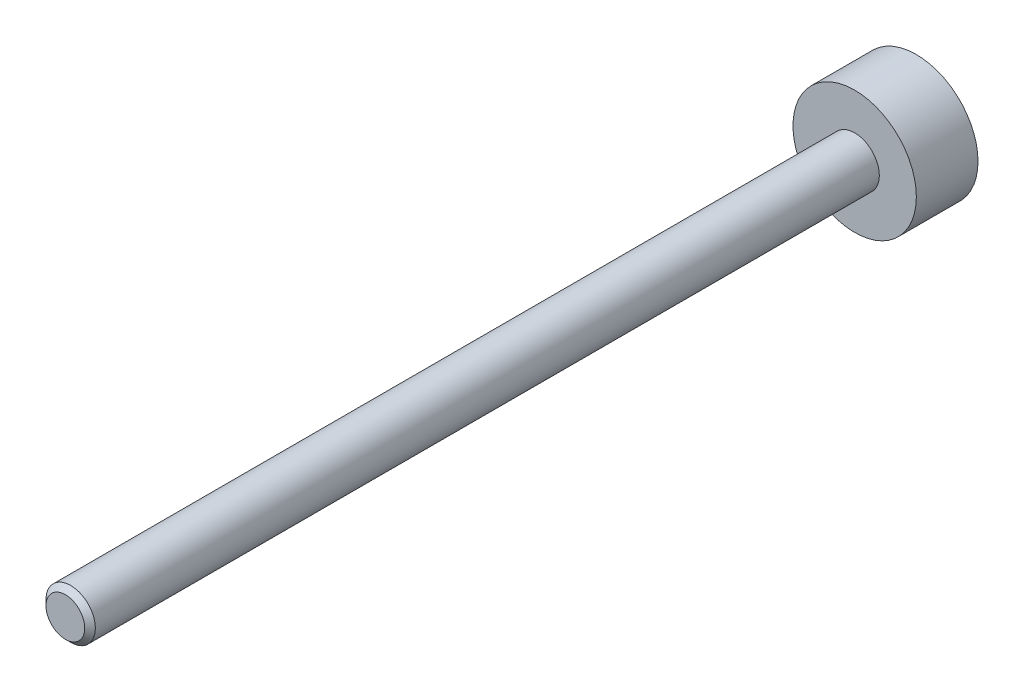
ISO-10303-21;
HEADER;
FILE_DESCRIPTION(('STEP AP214'),'2;1');
FILE_NAME('part.step','',(''),(''),'','','');
FILE_SCHEMA(('AUTOMOTIVE_DESIGN { 1 0 10303 214 1 1 1 1 }'));
ENDSEC;
DATA;
#1=APPLICATION_CONTEXT('core data for automotive mechanical design processes');
#2=APPLICATION_PROTOCOL_DEFINITION('international standard','automotive_design',2000,#1);
#3=PRODUCT_CONTEXT('',#1,'mechanical');
#4=PRODUCT('Part','Part','',(#3));
#5=PRODUCT_RELATED_PRODUCT_CATEGORY('part','',(#4));
#6=PRODUCT_DEFINITION_FORMATION('','',#4);
#7=PRODUCT_DEFINITION_CONTEXT('part definition',#1,'design');
#8=PRODUCT_DEFINITION('design','',#6,#7);
#9=PRODUCT_DEFINITION_SHAPE('','',#8);
#10=(LENGTH_UNIT() NAMED_UNIT(*) SI_UNIT(.MILLI.,.METRE.));
#11=(NAMED_UNIT(*) PLANE_ANGLE_UNIT() SI_UNIT($,.RADIAN.));
#12=(NAMED_UNIT(*) SI_UNIT($,.STERADIAN.) SOLID_ANGLE_UNIT());
#13=UNCERTAINTY_MEASURE_WITH_UNIT(LENGTH_MEASURE(1.E-05),#10,'distance_accuracy_value','');
#14=(GEOMETRIC_REPRESENTATION_CONTEXT(3) GLOBAL_UNCERTAINTY_ASSIGNED_CONTEXT((#13)) GLOBAL_UNIT_ASSIGNED_CONTEXT((#10,
#11,#12)) REPRESENTATION_CONTEXT('',''));
#15=CARTESIAN_POINT('',(0.,0.,0.));
#16=DIRECTION('',(0.,0.,1.));
#17=DIRECTION('',(1.,0.,0.));
#18=AXIS2_PLACEMENT_3D('',#15,#16,#17);
#19=CARTESIAN_POINT('',(0.,5.00000000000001,-53.));
#20=DIRECTION('',(0.,0.,1.));
#21=DIRECTION('',(1.,0.,0.));
#22=AXIS2_PLACEMENT_3D('',#19,#20,#21);
#23=PLANE('',#22);
#24=CARTESIAN_POINT('',(0.,0.,-53.));
#25=DIRECTION('',(0.,0.,1.));
#26=DIRECTION('',(1.,0.,0.));
#27=AXIS2_PLACEMENT_3D('',#24,#25,#26);
#28=CIRCLE('',#27,5.00000000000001);
#29=CARTESIAN_POINT('',(5.00000000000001,0.,-53.));
#30=VERTEX_POINT('',#29);
#31=EDGE_CURVE('E18',#30,#30,#28,.T.);
#32=ORIENTED_EDGE('',*,*,#31,.F.);
#33=EDGE_LOOP('',(#32));
#34=FACE_BOUND('',#33,.T.);
#35=ADVANCED_FACE('F15',(#34),#23,.F.);
#36=CARTESIAN_POINT('',(0.,0.,-53.));
#37=DIRECTION('',(0.,0.,1.));
#38=DIRECTION('',(1.,0.,0.));
#39=AXIS2_PLACEMENT_3D('',#36,#37,#38);
#40=CYLINDRICAL_SURFACE('',#39,5.00000000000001);
#41=CARTESIAN_POINT('',(0.,0.,-48.));
#42=DIRECTION('',(0.,0.,1.));
#43=DIRECTION('',(1.,0.,0.));
#44=AXIS2_PLACEMENT_3D('',#41,#42,#43);
#45=CIRCLE('',#44,5.00000000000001);
#46=CARTESIAN_POINT('',(5.00000000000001,0.,-48.));
#47=VERTEX_POINT('',#46);
#48=EDGE_CURVE('E31',#47,#47,#45,.F.);
#49=ORIENTED_EDGE('',*,*,#48,.T.);
#50=EDGE_LOOP('',(#49));
#51=FACE_BOUND('',#50,.T.);
#52=ORIENTED_EDGE('',*,*,#31,.T.);
#53=EDGE_LOOP('',(#52));
#54=FACE_BOUND('',#53,.T.);
#55=ADVANCED_FACE('F38',(#51,#54),#40,.T.);
#56=CARTESIAN_POINT('',(0.,0.,16.));
#57=DIRECTION('',(0.,0.,-1.));
#58=DIRECTION('',(-1.,0.,0.));
#59=AXIS2_PLACEMENT_3D('',#56,#57,#58);
#60=PLANE('',#59);
#61=CARTESIAN_POINT('',(0.,0.,16.0000000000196));
#62=DIRECTION('',(0.,0.,-1.));
#63=DIRECTION('',(-1.,0.,0.));
#64=AXIS2_PLACEMENT_3D('',#61,#62,#63);
#65=CIRCLE('',#64,1.57049999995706);
#66=CARTESIAN_POINT('',(-1.57049999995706,0.,16.0000000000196));
#67=VERTEX_POINT('',#66);
#68=EDGE_CURVE('E27',#67,#67,#65,.T.);
#69=ORIENTED_EDGE('',*,*,#68,.F.);
#70=EDGE_LOOP('',(#69));
#71=FACE_BOUND('',#70,.T.);
#72=ADVANCED_FACE('F45',(#71),#60,.F.);
#73=CARTESIAN_POINT('',(0.,2.,-48.));
#74=DIRECTION('',(0.,0.,-1.));
#75=DIRECTION('',(-1.,0.,0.));
#76=AXIS2_PLACEMENT_3D('',#73,#74,#75);
#77=PLANE('',#76);
#78=ORIENTED_EDGE('',*,*,#48,.F.);
#79=EDGE_LOOP('',(#78));
#80=FACE_BOUND('',#79,.T.);
#81=CARTESIAN_POINT('',(0.,0.,-48.));
#82=DIRECTION('',(0.,0.,1.));
#83=DIRECTION('',(1.,0.,0.));
#84=AXIS2_PLACEMENT_3D('',#81,#82,#83);
#85=CIRCLE('',#84,2.);
#86=CARTESIAN_POINT('',(2.,0.,-48.));
#87=VERTEX_POINT('',#86);
#88=EDGE_CURVE('E22',#87,#87,#85,.T.);
#89=ORIENTED_EDGE('',*,*,#88,.F.);
#90=EDGE_LOOP('',(#89));
#91=FACE_BOUND('',#90,.T.);
#92=ADVANCED_FACE('F53',(#80,#91),#77,.F.);
#93=CARTESIAN_POINT('',(0.,0.,15.5704999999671));
#94=DIRECTION('',(0.,0.,-1.));
#95=DIRECTION('',(-1.,0.,0.));
#96=AXIS2_PLACEMENT_3D('',#93,#94,#95);
#97=CONICAL_SURFACE('',#96,2.00000000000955,0.785398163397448);
#98=CARTESIAN_POINT('',(0.,0.,15.5705));
#99=DIRECTION('',(0.,0.,1.));
#100=DIRECTION('',(1.,0.,0.));
#101=AXIS2_PLACEMENT_3D('',#98,#99,#100);
#102=CIRCLE('',#101,2.);
#103=CARTESIAN_POINT('',(2.,0.,15.5705));
#104=VERTEX_POINT('',#103);
#105=EDGE_CURVE('E10',#104,#104,#102,.F.);
#106=ORIENTED_EDGE('',*,*,#105,.F.);
#107=EDGE_LOOP('',(#106));
#108=FACE_BOUND('',#107,.T.);
#109=ORIENTED_EDGE('',*,*,#68,.T.);
#110=EDGE_LOOP('',(#109));
#111=FACE_BOUND('',#110,.T.);
#112=ADVANCED_FACE('F48',(#108,#111),#97,.T.);
#113=CARTESIAN_POINT('',(0.,0.,-53.));
#114=DIRECTION('',(0.,0.,1.));
#115=DIRECTION('',(1.,0.,0.));
#116=AXIS2_PLACEMENT_3D('',#113,#114,#115);
#117=CYLINDRICAL_SURFACE('',#116,2.);
#118=ORIENTED_EDGE('',*,*,#105,.T.);
#119=EDGE_LOOP('',(#118));
#120=FACE_BOUND('',#119,.T.);
#121=ORIENTED_EDGE('',*,*,#88,.T.);
#122=EDGE_LOOP('',(#121));
#123=FACE_BOUND('',#122,.T.);
#124=ADVANCED_FACE('F46',(#120,#123),#117,.T.);
#125=CLOSED_SHELL('',(#35,#55,#72,#92,#112,#124));
#126=MANIFOLD_SOLID_BREP('B1',#125);
#127=ADVANCED_BREP_SHAPE_REPRESENTATION('',(#18,#126),#14);
#128=SHAPE_DEFINITION_REPRESENTATION(#9,#127);
ENDSEC;
END-ISO-10303-21;
